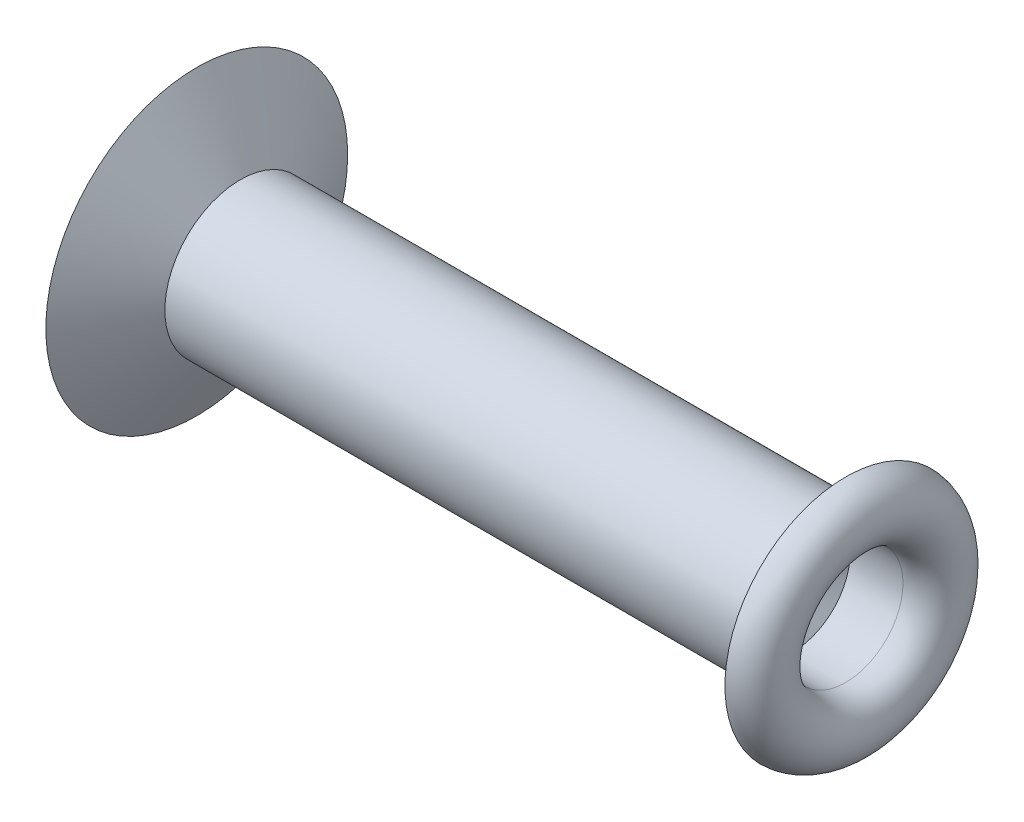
from build123d import *


with BuildPart() as part:
    # Sketch1 → Base-Revolve (revolve)
    with BuildSketch(Plane.XY, mode=Mode.PRIVATE) as base_revolve_sk:
        with BuildLine():
            Line((0, 8), (0, 6.794144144))
            ThreePointArc((0, 6.794144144), (0.796034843, 5.848666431), (-0.1025, 5))
            Line((-0.1025, 5), (-40.113248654, 5))
            Line((-40.113248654, 5), (-43, 10))
            Line((-43, 10), (-43, 0))
            Line((-43, 0), (-5.783270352, 0))
            Line((-5.783270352, 0), (-3.5, 3.8))
            Line((-3.5, 3.8), (0, 3.8))
            ThreePointArc((0, 3.8), (2, 5.9), (0, 8))
        make_face()
    revolve(base_revolve_sk.sketch.rotate(Axis((40.376928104, 0, 0), (-1, 0, 0)), 90), axis=Axis((40.376928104, 0, 0), (-1, 0, 0)))


solid = part.part
